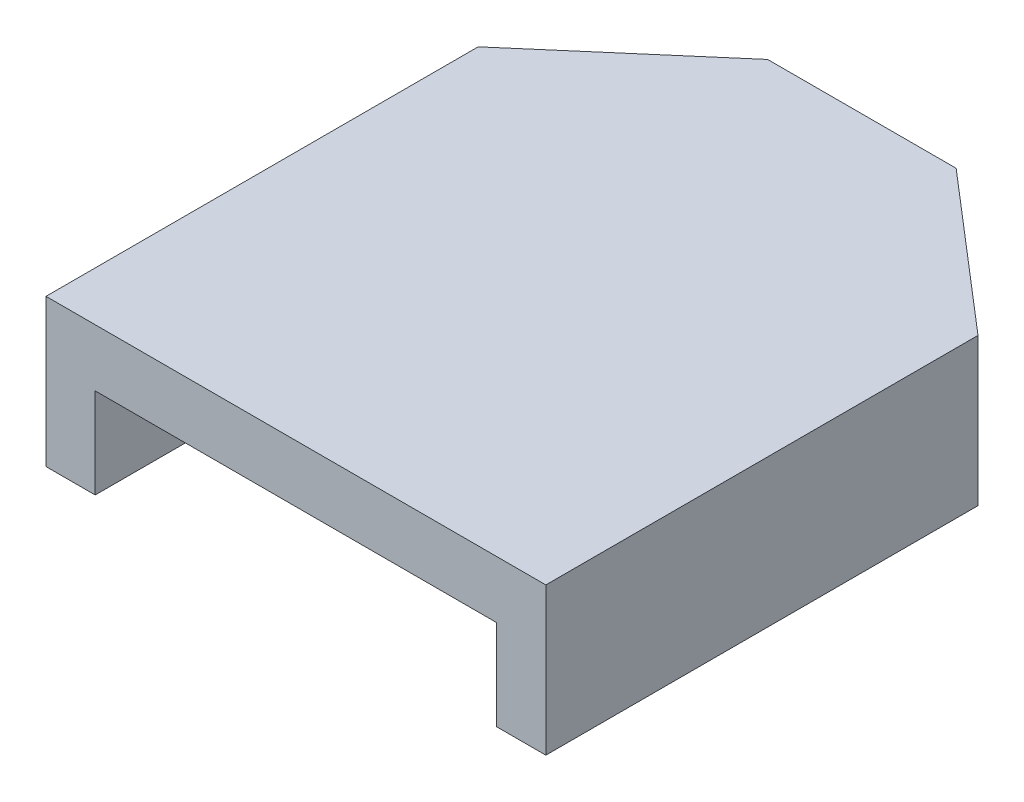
ISO-10303-21;
HEADER;
FILE_DESCRIPTION(('STEP AP214'),'2;1');
FILE_NAME('part.step','',(''),(''),'','','');
FILE_SCHEMA(('AUTOMOTIVE_DESIGN { 1 0 10303 214 1 1 1 1 }'));
ENDSEC;
DATA;
#1=APPLICATION_CONTEXT('core data for automotive mechanical design processes');
#2=APPLICATION_PROTOCOL_DEFINITION('international standard','automotive_design',2000,#1);
#3=PRODUCT_CONTEXT('',#1,'mechanical');
#4=PRODUCT('Part','Part','',(#3));
#5=PRODUCT_RELATED_PRODUCT_CATEGORY('part','',(#4));
#6=PRODUCT_DEFINITION_FORMATION('','',#4);
#7=PRODUCT_DEFINITION_CONTEXT('part definition',#1,'design');
#8=PRODUCT_DEFINITION('design','',#6,#7);
#9=PRODUCT_DEFINITION_SHAPE('','',#8);
#10=(LENGTH_UNIT() NAMED_UNIT(*) SI_UNIT(.MILLI.,.METRE.));
#11=(NAMED_UNIT(*) PLANE_ANGLE_UNIT() SI_UNIT($,.RADIAN.));
#12=(NAMED_UNIT(*) SI_UNIT($,.STERADIAN.) SOLID_ANGLE_UNIT());
#13=UNCERTAINTY_MEASURE_WITH_UNIT(LENGTH_MEASURE(1.E-05),#10,'distance_accuracy_value','');
#14=(GEOMETRIC_REPRESENTATION_CONTEXT(3) GLOBAL_UNCERTAINTY_ASSIGNED_CONTEXT((#13)) GLOBAL_UNIT_ASSIGNED_CONTEXT((#10,
#11,#12)) REPRESENTATION_CONTEXT('',''));
#15=CARTESIAN_POINT('',(0.,0.,0.));
#16=DIRECTION('',(0.,0.,1.));
#17=DIRECTION('',(1.,0.,0.));
#18=AXIS2_PLACEMENT_3D('',#15,#16,#17);
#19=CARTESIAN_POINT('',(0.,0.,-27.6098));
#20=DIRECTION('',(0.,-1.,0.));
#21=DIRECTION('',(0.,0.,-1.));
#22=AXIS2_PLACEMENT_3D('',#19,#20,#21);
#23=PLANE('',#22);
#24=DIRECTION('',(1.,0.,0.));
#25=VECTOR('',#24,1.);
#26=CARTESIAN_POINT('',(24.384,0.,-21.082));
#27=LINE('',#26,#25);
#28=CARTESIAN_POINT('',(21.984,0.,-21.082));
#29=VERTEX_POINT('',#28);
#30=CARTESIAN_POINT('',(24.384,0.,-21.082));
#31=VERTEX_POINT('',#30);
#32=EDGE_CURVE('E130',#29,#31,#27,.T.);
#33=ORIENTED_EDGE('',*,*,#32,.F.);
#34=DIRECTION('',(0.,0.,-1.));
#35=VECTOR('',#34,1.);
#36=CARTESIAN_POINT('',(21.984,0.,0.));
#37=LINE('',#36,#35);
#38=CARTESIAN_POINT('',(21.984,0.,0.));
#39=VERTEX_POINT('',#38);
#40=EDGE_CURVE('E118',#39,#29,#37,.T.);
#41=ORIENTED_EDGE('',*,*,#40,.F.);
#42=DIRECTION('',(1.,0.,0.));
#43=VECTOR('',#42,1.);
#44=CARTESIAN_POINT('',(0.,0.,0.));
#45=LINE('',#44,#43);
#46=CARTESIAN_POINT('',(2.4,0.,0.));
#47=VERTEX_POINT('',#46);
#48=EDGE_CURVE('E47',#47,#39,#45,.T.);
#49=ORIENTED_EDGE('',*,*,#48,.F.);
#50=DIRECTION('',(0.,0.,1.));
#51=VECTOR('',#50,1.);
#52=CARTESIAN_POINT('',(2.4,0.,0.));
#53=LINE('',#52,#51);
#54=CARTESIAN_POINT('',(2.4,0.,-21.082));
#55=VERTEX_POINT('',#54);
#56=EDGE_CURVE('E148',#55,#47,#53,.T.);
#57=ORIENTED_EDGE('',*,*,#56,.F.);
#58=DIRECTION('',(1.,0.,0.));
#59=VECTOR('',#58,1.);
#60=CARTESIAN_POINT('',(0.,0.,-21.082));
#61=LINE('',#60,#59);
#62=CARTESIAN_POINT('',(0.,0.,-21.082));
#63=VERTEX_POINT('',#62);
#64=EDGE_CURVE('E124',#63,#55,#61,.T.);
#65=ORIENTED_EDGE('',*,*,#64,.F.);
#66=DIRECTION('',(-0.75836071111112,0.,0.651835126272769));
#67=VECTOR('',#66,1.);
#68=CARTESIAN_POINT('',(0.,0.,-21.082));
#69=LINE('',#68,#67);
#70=CARTESIAN_POINT('',(7.5946,0.,-27.6098));
#71=VERTEX_POINT('',#70);
#72=EDGE_CURVE('E154',#71,#63,#69,.T.);
#73=ORIENTED_EDGE('',*,*,#72,.F.);
#74=DIRECTION('',(-1.,0.,0.));
#75=VECTOR('',#74,1.);
#76=CARTESIAN_POINT('',(7.5946,0.,-27.6098));
#77=LINE('',#76,#75);
#78=CARTESIAN_POINT('',(16.7894,0.,-27.6098));
#79=VERTEX_POINT('',#78);
#80=EDGE_CURVE('E140',#79,#71,#77,.T.);
#81=ORIENTED_EDGE('',*,*,#80,.F.);
#82=DIRECTION('',(-0.75836071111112,0.,-0.651835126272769));
#83=VECTOR('',#82,1.);
#84=CARTESIAN_POINT('',(16.7894,0.,-27.6098));
#85=LINE('',#84,#83);
#86=EDGE_CURVE('E137',#31,#79,#85,.T.);
#87=ORIENTED_EDGE('',*,*,#86,.F.);
#88=EDGE_LOOP('',(#33,#41,#49,#57,#65,#73,#81,#87));
#89=FACE_BOUND('',#88,.T.);
#90=ADVANCED_FACE('F30',(#89),#23,.T.);
#91=CARTESIAN_POINT('',(0.,2.794,0.));
#92=DIRECTION('',(1.,0.,0.));
#93=DIRECTION('',(0.,0.,-1.));
#94=AXIS2_PLACEMENT_3D('',#91,#92,#93);
#95=PLANE('',#94);
#96=DIRECTION('',(0.,-1.,0.));
#97=VECTOR('',#96,1.);
#98=CARTESIAN_POINT('',(0.,2.794,-21.082));
#99=LINE('',#98,#97);
#100=CARTESIAN_POINT('',(0.,2.794,-21.082));
#101=VERTEX_POINT('',#100);
#102=EDGE_CURVE('E168',#101,#63,#99,.T.);
#103=ORIENTED_EDGE('',*,*,#102,.T.);
#104=DIRECTION('',(0.,1.,0.));
#105=VECTOR('',#104,1.);
#106=CARTESIAN_POINT('',(0.,-4.4,-21.082));
#107=LINE('',#106,#105);
#108=CARTESIAN_POINT('',(0.,-4.4,-21.082));
#109=VERTEX_POINT('',#108);
#110=EDGE_CURVE('E138',#109,#63,#107,.T.);
#111=ORIENTED_EDGE('',*,*,#110,.F.);
#112=DIRECTION('',(0.,0.,-1.));
#113=VECTOR('',#112,1.);
#114=CARTESIAN_POINT('',(0.,-4.4,0.));
#115=LINE('',#114,#113);
#116=CARTESIAN_POINT('',(0.,-4.4,0.));
#117=VERTEX_POINT('',#116);
#118=EDGE_CURVE('E205',#117,#109,#115,.T.);
#119=ORIENTED_EDGE('',*,*,#118,.F.);
#120=DIRECTION('',(0.,-1.,0.));
#121=VECTOR('',#120,1.);
#122=CARTESIAN_POINT('',(0.,2.794,0.));
#123=LINE('',#122,#121);
#124=CARTESIAN_POINT('',(0.,2.794,0.));
#125=VERTEX_POINT('',#124);
#126=EDGE_CURVE('E11',#125,#117,#123,.T.);
#127=ORIENTED_EDGE('',*,*,#126,.F.);
#128=DIRECTION('',(0.,0.,1.));
#129=VECTOR('',#128,1.);
#130=CARTESIAN_POINT('',(0.,2.794,0.));
#131=LINE('',#130,#129);
#132=EDGE_CURVE('E157',#101,#125,#131,.T.);
#133=ORIENTED_EDGE('',*,*,#132,.F.);
#134=EDGE_LOOP('',(#103,#111,#119,#127,#133));
#135=FACE_BOUND('',#134,.T.);
#136=ADVANCED_FACE('F32',(#135),#95,.F.);
#137=CARTESIAN_POINT('',(0.,2.794,0.));
#138=DIRECTION('',(0.,0.,-1.));
#139=DIRECTION('',(-1.,0.,0.));
#140=AXIS2_PLACEMENT_3D('',#137,#138,#139);
#141=PLANE('',#140);
#142=ORIENTED_EDGE('',*,*,#126,.T.);
#143=DIRECTION('',(-1.,0.,0.));
#144=VECTOR('',#143,1.);
#145=CARTESIAN_POINT('',(0.,-4.4,0.));
#146=LINE('',#145,#144);
#147=CARTESIAN_POINT('',(2.4,-4.4,0.));
#148=VERTEX_POINT('',#147);
#149=EDGE_CURVE('E212',#148,#117,#146,.T.);
#150=ORIENTED_EDGE('',*,*,#149,.F.);
#151=DIRECTION('',(0.,1.,0.));
#152=VECTOR('',#151,1.);
#153=CARTESIAN_POINT('',(2.4,-4.4,0.));
#154=LINE('',#153,#152);
#155=EDGE_CURVE('E136',#148,#47,#154,.T.);
#156=ORIENTED_EDGE('',*,*,#155,.T.);
#157=ORIENTED_EDGE('',*,*,#48,.T.);
#158=DIRECTION('',(0.,1.,0.));
#159=VECTOR('',#158,1.);
#160=CARTESIAN_POINT('',(21.984,-4.4,0.));
#161=LINE('',#160,#159);
#162=CARTESIAN_POINT('',(21.984,-4.4,0.));
#163=VERTEX_POINT('',#162);
#164=EDGE_CURVE('E115',#163,#39,#161,.T.);
#165=ORIENTED_EDGE('',*,*,#164,.F.);
#166=DIRECTION('',(-1.,0.,0.));
#167=VECTOR('',#166,1.);
#168=CARTESIAN_POINT('',(24.384,-4.4,0.));
#169=LINE('',#168,#167);
#170=CARTESIAN_POINT('',(24.384,-4.4,0.));
#171=VERTEX_POINT('',#170);
#172=EDGE_CURVE('E189',#171,#163,#169,.T.);
#173=ORIENTED_EDGE('',*,*,#172,.F.);
#174=DIRECTION('',(0.,-1.,0.));
#175=VECTOR('',#174,1.);
#176=CARTESIAN_POINT('',(24.384,2.794,0.));
#177=LINE('',#176,#175);
#178=CARTESIAN_POINT('',(24.384,2.794,0.));
#179=VERTEX_POINT('',#178);
#180=EDGE_CURVE('E39',#179,#171,#177,.T.);
#181=ORIENTED_EDGE('',*,*,#180,.F.);
#182=DIRECTION('',(1.,0.,0.));
#183=VECTOR('',#182,1.);
#184=CARTESIAN_POINT('',(0.,2.794,0.));
#185=LINE('',#184,#183);
#186=EDGE_CURVE('E159',#125,#179,#185,.T.);
#187=ORIENTED_EDGE('',*,*,#186,.F.);
#188=EDGE_LOOP('',(#142,#150,#156,#157,#165,#173,#181,#187));
#189=FACE_BOUND('',#188,.T.);
#190=ADVANCED_FACE('F133',(#189),#141,.F.);
#191=CARTESIAN_POINT('',(24.384,2.794,0.));
#192=DIRECTION('',(-1.,0.,0.));
#193=DIRECTION('',(0.,0.,1.));
#194=AXIS2_PLACEMENT_3D('',#191,#192,#193);
#195=PLANE('',#194);
#196=ORIENTED_EDGE('',*,*,#180,.T.);
#197=DIRECTION('',(0.,0.,1.));
#198=VECTOR('',#197,1.);
#199=CARTESIAN_POINT('',(24.384,-4.4,0.));
#200=LINE('',#199,#198);
#201=CARTESIAN_POINT('',(24.384,-4.4,-21.082));
#202=VERTEX_POINT('',#201);
#203=EDGE_CURVE('E185',#202,#171,#200,.T.);
#204=ORIENTED_EDGE('',*,*,#203,.F.);
#205=DIRECTION('',(0.,1.,0.));
#206=VECTOR('',#205,1.);
#207=CARTESIAN_POINT('',(24.384,-4.4,-21.082));
#208=LINE('',#207,#206);
#209=EDGE_CURVE('E193',#202,#31,#208,.T.);
#210=ORIENTED_EDGE('',*,*,#209,.T.);
#211=DIRECTION('',(0.,-1.,0.));
#212=VECTOR('',#211,1.);
#213=CARTESIAN_POINT('',(24.384,2.794,-21.082));
#214=LINE('',#213,#212);
#215=CARTESIAN_POINT('',(24.384,2.794,-21.082));
#216=VERTEX_POINT('',#215);
#217=EDGE_CURVE('E177',#216,#31,#214,.T.);
#218=ORIENTED_EDGE('',*,*,#217,.F.);
#219=DIRECTION('',(0.,0.,-1.));
#220=VECTOR('',#219,1.);
#221=CARTESIAN_POINT('',(24.384,2.794,0.));
#222=LINE('',#221,#220);
#223=EDGE_CURVE('E161',#179,#216,#222,.T.);
#224=ORIENTED_EDGE('',*,*,#223,.F.);
#225=EDGE_LOOP('',(#196,#204,#210,#218,#224));
#226=FACE_BOUND('',#225,.T.);
#227=ADVANCED_FACE('F184',(#226),#195,.F.);
#228=CARTESIAN_POINT('',(16.7894,2.794,-27.6098));
#229=DIRECTION('',(-0.651835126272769,0.,0.75836071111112));
#230=DIRECTION('',(0.75836071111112,0.,0.651835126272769));
#231=AXIS2_PLACEMENT_3D('',#228,#229,#230);
#232=PLANE('',#231);
#233=ORIENTED_EDGE('',*,*,#86,.T.);
#234=DIRECTION('',(0.,-1.,0.));
#235=VECTOR('',#234,1.);
#236=CARTESIAN_POINT('',(16.7894,2.794,-27.6098));
#237=LINE('',#236,#235);
#238=CARTESIAN_POINT('',(16.7894,2.794,-27.6098));
#239=VERTEX_POINT('',#238);
#240=EDGE_CURVE('E174',#239,#79,#237,.T.);
#241=ORIENTED_EDGE('',*,*,#240,.F.);
#242=DIRECTION('',(-0.75836071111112,0.,-0.651835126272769));
#243=VECTOR('',#242,1.);
#244=CARTESIAN_POINT('',(16.7894,2.794,-27.6098));
#245=LINE('',#244,#243);
#246=EDGE_CURVE('E163',#216,#239,#245,.T.);
#247=ORIENTED_EDGE('',*,*,#246,.F.);
#248=ORIENTED_EDGE('',*,*,#217,.T.);
#249=EDGE_LOOP('',(#233,#241,#247,#248));
#250=FACE_BOUND('',#249,.T.);
#251=ADVANCED_FACE('F257',(#250),#232,.F.);
#252=CARTESIAN_POINT('',(7.5946,2.794,-27.6098));
#253=DIRECTION('',(0.,0.,1.));
#254=DIRECTION('',(1.,0.,0.));
#255=AXIS2_PLACEMENT_3D('',#252,#253,#254);
#256=PLANE('',#255);
#257=ORIENTED_EDGE('',*,*,#80,.T.);
#258=DIRECTION('',(0.,-1.,0.));
#259=VECTOR('',#258,1.);
#260=CARTESIAN_POINT('',(7.5946,2.794,-27.6098));
#261=LINE('',#260,#259);
#262=CARTESIAN_POINT('',(7.5946,2.794,-27.6098));
#263=VERTEX_POINT('',#262);
#264=EDGE_CURVE('E171',#263,#71,#261,.T.);
#265=ORIENTED_EDGE('',*,*,#264,.F.);
#266=DIRECTION('',(-1.,0.,0.));
#267=VECTOR('',#266,1.);
#268=CARTESIAN_POINT('',(7.5946,2.794,-27.6098));
#269=LINE('',#268,#267);
#270=EDGE_CURVE('E165',#239,#263,#269,.T.);
#271=ORIENTED_EDGE('',*,*,#270,.F.);
#272=ORIENTED_EDGE('',*,*,#240,.T.);
#273=EDGE_LOOP('',(#257,#265,#271,#272));
#274=FACE_BOUND('',#273,.T.);
#275=ADVANCED_FACE('F254',(#274),#256,.F.);
#276=CARTESIAN_POINT('',(0.,2.794,-21.082));
#277=DIRECTION('',(0.651835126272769,0.,0.75836071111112));
#278=DIRECTION('',(0.75836071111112,0.,-0.651835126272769));
#279=AXIS2_PLACEMENT_3D('',#276,#277,#278);
#280=PLANE('',#279);
#281=ORIENTED_EDGE('',*,*,#72,.T.);
#282=ORIENTED_EDGE('',*,*,#102,.F.);
#283=DIRECTION('',(-0.75836071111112,0.,0.651835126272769));
#284=VECTOR('',#283,1.);
#285=CARTESIAN_POINT('',(0.,2.794,-21.082));
#286=LINE('',#285,#284);
#287=EDGE_CURVE('E55',#263,#101,#286,.T.);
#288=ORIENTED_EDGE('',*,*,#287,.F.);
#289=ORIENTED_EDGE('',*,*,#264,.T.);
#290=EDGE_LOOP('',(#281,#282,#288,#289));
#291=FACE_BOUND('',#290,.T.);
#292=ADVANCED_FACE('F225',(#291),#280,.F.);
#293=CARTESIAN_POINT('',(0.,2.794,-27.6098));
#294=DIRECTION('',(0.,-1.,0.));
#295=DIRECTION('',(0.,0.,-1.));
#296=AXIS2_PLACEMENT_3D('',#293,#294,#295);
#297=PLANE('',#296);
#298=ORIENTED_EDGE('',*,*,#132,.T.);
#299=ORIENTED_EDGE('',*,*,#186,.T.);
#300=ORIENTED_EDGE('',*,*,#223,.T.);
#301=ORIENTED_EDGE('',*,*,#246,.T.);
#302=ORIENTED_EDGE('',*,*,#270,.T.);
#303=ORIENTED_EDGE('',*,*,#287,.T.);
#304=EDGE_LOOP('',(#298,#299,#300,#301,#302,#303));
#305=FACE_BOUND('',#304,.T.);
#306=ADVANCED_FACE('F231',(#305),#297,.F.);
#307=CARTESIAN_POINT('',(0.,-4.4,-21.082));
#308=DIRECTION('',(0.,0.,1.));
#309=DIRECTION('',(1.,0.,0.));
#310=AXIS2_PLACEMENT_3D('',#307,#308,#309);
#311=PLANE('',#310);
#312=ORIENTED_EDGE('',*,*,#64,.T.);
#313=DIRECTION('',(0.,1.,0.));
#314=VECTOR('',#313,1.);
#315=CARTESIAN_POINT('',(2.4,-4.4,-21.082));
#316=LINE('',#315,#314);
#317=CARTESIAN_POINT('',(2.4,-4.4,-21.082));
#318=VERTEX_POINT('',#317);
#319=EDGE_CURVE('E143',#318,#55,#316,.T.);
#320=ORIENTED_EDGE('',*,*,#319,.F.);
#321=DIRECTION('',(1.,0.,0.));
#322=VECTOR('',#321,1.);
#323=CARTESIAN_POINT('',(0.,-4.4,-21.082));
#324=LINE('',#323,#322);
#325=EDGE_CURVE('E208',#109,#318,#324,.T.);
#326=ORIENTED_EDGE('',*,*,#325,.F.);
#327=ORIENTED_EDGE('',*,*,#110,.T.);
#328=EDGE_LOOP('',(#312,#320,#326,#327));
#329=FACE_BOUND('',#328,.T.);
#330=ADVANCED_FACE('F220',(#329),#311,.F.);
#331=CARTESIAN_POINT('',(2.4,-4.4,0.));
#332=DIRECTION('',(-1.,0.,0.));
#333=DIRECTION('',(0.,0.,1.));
#334=AXIS2_PLACEMENT_3D('',#331,#332,#333);
#335=PLANE('',#334);
#336=ORIENTED_EDGE('',*,*,#56,.T.);
#337=ORIENTED_EDGE('',*,*,#155,.F.);
#338=DIRECTION('',(0.,0.,1.));
#339=VECTOR('',#338,1.);
#340=CARTESIAN_POINT('',(2.4,-4.4,0.));
#341=LINE('',#340,#339);
#342=EDGE_CURVE('E210',#318,#148,#341,.T.);
#343=ORIENTED_EDGE('',*,*,#342,.F.);
#344=ORIENTED_EDGE('',*,*,#319,.T.);
#345=EDGE_LOOP('',(#336,#337,#343,#344));
#346=FACE_BOUND('',#345,.T.);
#347=ADVANCED_FACE('F218',(#346),#335,.F.);
#348=CARTESIAN_POINT('',(0.,-4.4,-21.082));
#349=DIRECTION('',(0.,-1.,0.));
#350=DIRECTION('',(0.,0.,-1.));
#351=AXIS2_PLACEMENT_3D('',#348,#349,#350);
#352=PLANE('',#351);
#353=ORIENTED_EDGE('',*,*,#118,.T.);
#354=ORIENTED_EDGE('',*,*,#325,.T.);
#355=ORIENTED_EDGE('',*,*,#342,.T.);
#356=ORIENTED_EDGE('',*,*,#149,.T.);
#357=EDGE_LOOP('',(#353,#354,#355,#356));
#358=FACE_BOUND('',#357,.T.);
#359=ADVANCED_FACE('F233',(#358),#352,.T.);
#360=CARTESIAN_POINT('',(21.984,-4.4,0.));
#361=DIRECTION('',(1.,0.,0.));
#362=DIRECTION('',(0.,0.,-1.));
#363=AXIS2_PLACEMENT_3D('',#360,#361,#362);
#364=PLANE('',#363);
#365=ORIENTED_EDGE('',*,*,#40,.T.);
#366=DIRECTION('',(0.,1.,0.));
#367=VECTOR('',#366,1.);
#368=CARTESIAN_POINT('',(21.984,-4.4,-21.082));
#369=LINE('',#368,#367);
#370=CARTESIAN_POINT('',(21.984,-4.4,-21.082));
#371=VERTEX_POINT('',#370);
#372=EDGE_CURVE('E125',#371,#29,#369,.T.);
#373=ORIENTED_EDGE('',*,*,#372,.F.);
#374=DIRECTION('',(0.,0.,-1.));
#375=VECTOR('',#374,1.);
#376=CARTESIAN_POINT('',(21.984,-4.4,0.));
#377=LINE('',#376,#375);
#378=EDGE_CURVE('E120',#163,#371,#377,.T.);
#379=ORIENTED_EDGE('',*,*,#378,.F.);
#380=ORIENTED_EDGE('',*,*,#164,.T.);
#381=EDGE_LOOP('',(#365,#373,#379,#380));
#382=FACE_BOUND('',#381,.T.);
#383=ADVANCED_FACE('F116',(#382),#364,.F.);
#384=CARTESIAN_POINT('',(24.384,-4.4,-21.082));
#385=DIRECTION('',(0.,0.,1.));
#386=DIRECTION('',(1.,0.,0.));
#387=AXIS2_PLACEMENT_3D('',#384,#385,#386);
#388=PLANE('',#387);
#389=ORIENTED_EDGE('',*,*,#32,.T.);
#390=ORIENTED_EDGE('',*,*,#209,.F.);
#391=DIRECTION('',(1.,0.,0.));
#392=VECTOR('',#391,1.);
#393=CARTESIAN_POINT('',(24.384,-4.4,-21.082));
#394=LINE('',#393,#392);
#395=EDGE_CURVE('E191',#371,#202,#394,.T.);
#396=ORIENTED_EDGE('',*,*,#395,.F.);
#397=ORIENTED_EDGE('',*,*,#372,.T.);
#398=EDGE_LOOP('',(#389,#390,#396,#397));
#399=FACE_BOUND('',#398,.T.);
#400=ADVANCED_FACE('F240',(#399),#388,.F.);
#401=CARTESIAN_POINT('',(24.384,-4.4,0.));
#402=DIRECTION('',(0.,-1.,0.));
#403=DIRECTION('',(0.,0.,-1.));
#404=AXIS2_PLACEMENT_3D('',#401,#402,#403);
#405=PLANE('',#404);
#406=ORIENTED_EDGE('',*,*,#172,.T.);
#407=ORIENTED_EDGE('',*,*,#378,.T.);
#408=ORIENTED_EDGE('',*,*,#395,.T.);
#409=ORIENTED_EDGE('',*,*,#203,.T.);
#410=EDGE_LOOP('',(#406,#407,#408,#409));
#411=FACE_BOUND('',#410,.T.);
#412=ADVANCED_FACE('F188',(#411),#405,.T.);
#413=CLOSED_SHELL('',(#90,#136,#190,#227,#251,#275,#292,#306,#330,#347,#359,#383,#400,#412));
#414=MANIFOLD_SOLID_BREP('B2',#413);
#415=ADVANCED_BREP_SHAPE_REPRESENTATION('',(#18,#414),#14);
#416=SHAPE_DEFINITION_REPRESENTATION(#9,#415);
ENDSEC;
END-ISO-10303-21;
